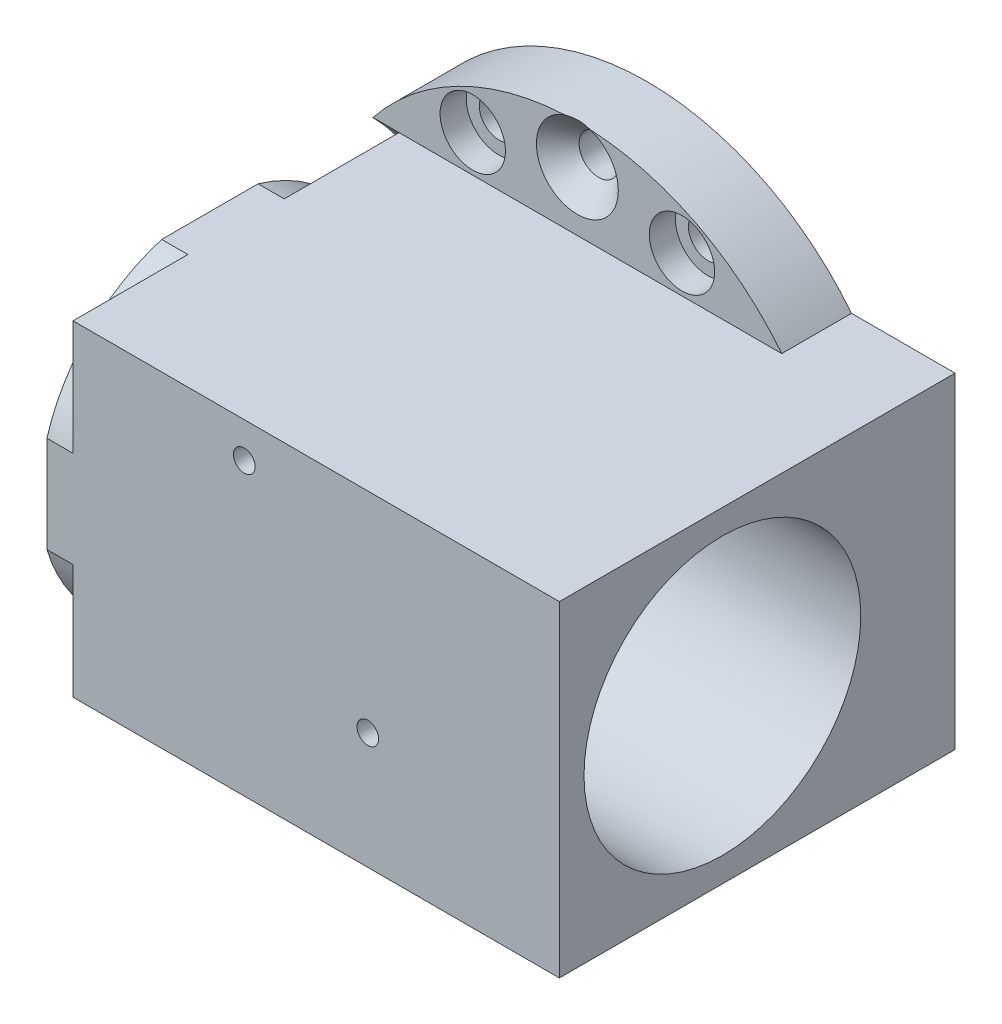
from build123d import *

# Parameters (mm, degrees)
BOSS_EXTRUDE1_DEPTH                                 = 8
CUT_EXTRUDE1_REACH                                  = 65.856
SKETCH4_W                                           = 55.8
SKETCH4_H                                           = 37.4
BOSS_EXTRUDE2_DEPTH                                 = 37.4
BOSS_EXTRUDE3_DEPTH                                 = 3
CUT_EXTRUDE2_START                                  = -3
CUT_EXTRUDE2_DEPTH                                  = 3
CUT_EXTRUDE3_START                                  = -3
CUT_EXTRUDE3_DEPTH                                  = 3
CSK_FOR_8_FLAT_HEAD_MACHINE_SCREW_100_D             = 4.5
CSK_FOR_8_FLAT_HEAD_MACHINE_SCREW_100_CSINK_D       = 9.4
CSK_FOR_8_FLAT_HEAD_MACHINE_SCREW_100_CSINK_ANGLE   = 90
F_4_CLEARANCE_HOLE1_D                               = 3.3
F_4_CLEARANCE_HOLE1_DEPTH                           = 6
CBORE_FOR_8_BINDING_HEAD_MACHINE_SCREW1_D           = 4.5
CBORE_FOR_8_BINDING_HEAD_MACHINE_SCREW1_CBORE_D     = 7.5
CBORE_FOR_8_BINDING_HEAD_MACHINE_SCREW1_CBORE_DEPTH = 3
F_2_CLEARANCE_HOLE1_D                               = 2.5
F_2_CLEARANCE_HOLE1_DEPTH                           = 6
F_2_CLEARANCE_HOLE2_REACH                           = 66.886
F_2_CLEARANCE_HOLE2_BORE_R                          = 1.25


with BuildPart() as part:
    # Sketch1 → Boss-Extrude1 (new body)
    with BuildSketch(Plane.XY.offset(8)):
        with BuildLine():
            Line((-23.45868709, 18.7), (-23.45868709, -18.7))
            ThreePointArc((-23.45868709, -18.7), (0, -30), (23.45868709, -18.7))
            Line((23.45868709, -18.7), (35.34131291, -18.7))
            Line((35.34131291, -18.7), (35.34131291, 18.7))
            Line((35.34131291, 18.7), (23.45868709, 18.7))
            ThreePointArc((23.45868709, 18.7), (0, 30), (-23.45868709, 18.7))
        make_face()
    extrude(amount=-BOSS_EXTRUDE1_DEPTH)

    # Sketch3 → Cut-Extrude1 (cut, up to next)
    with BuildSketch(Plane(origin=(-20.45868709, 0, 0), x_dir=(0, 0, -1), z_dir=(1, 0, 0)), mode=Mode.PRIVATE) as cut_extrude1_sk1:
        with BuildLine():
            Line((-8, 18.7), (-8, -18.7))
            ThreePointArc((-8, -18.7), (-0.254206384, 0), (-8, 18.7))
        make_face()
    cut_extrude1_tool1 = extrude(cut_extrude1_sk1.sketch, amount=-CUT_EXTRUDE1_REACH, mode=Mode.PRIVATE) & part.part
    add(cut_extrude1_tool1.solids().sort_by_distance((-20.458687, 0, 4.859168))[0], mode=Mode.SUBTRACT)

    # Sketch4 → Boss-Extrude2 (add)
    with BuildSketch(Plane.XY.offset(8)):
        with Locations((7.44131291, 0)):
            Rectangle(SKETCH4_W, SKETCH4_H)
    extrude(amount=BOSS_EXTRUDE2_DEPTH)

    # Sketch5 → Boss-Extrude3 (add)
    with BuildSketch(Plane.ZY.offset(20.45868709)):
        with BuildLine():
            Line((21.171890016, 18.7), (45.4, 18.7))
            Line((45.4, 18.7), (45.4, -18.7))
            Line((45.4, -18.7), (21.171890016, -18.7))
            ThreePointArc((21.171890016, -18.7), (7.2, 0), (21.171890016, 18.7))
        make_face()
    extrude(amount=BOSS_EXTRUDE3_DEPTH)

    # Sketch6 → Cut-Extrude2 (cut)
    with BuildSketch(Plane.ZY.offset(23.45868709).offset(CUT_EXTRUDE2_START)):
        with BuildLine():
            Line((45.4, -18.7), (45.4, -5.528109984))
            ThreePointArc((45.4, -5.528109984), (40.488582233, -13.788582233), (32.228109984, -18.7))
            Line((32.228109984, -18.7), (45.4, -18.7))
        make_face()
    extrude(amount=CUT_EXTRUDE2_DEPTH, mode=Mode.SUBTRACT)

    # Sketch7 → Cut-Extrude3 (cut)
    with BuildSketch(Plane.ZY.offset(23.45868709).offset(CUT_EXTRUDE3_START)):
        with BuildLine():
            Line((45.4, 18.7), (32.228109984, 18.7))
            ThreePointArc((32.228109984, 18.7), (40.488582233, 13.788582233), (45.4, 5.528109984))
            Line((45.4, 5.528109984), (45.4, 18.7))
        make_face()
    extrude(amount=CUT_EXTRUDE3_DEPTH, mode=Mode.SUBTRACT)

    # Sketch8 → Cut-Revolve1 (revolve, cut)
    with BuildSketch(Plane.XY.offset(26.7)):
        Polygon((-23.45868709, 15.875), (-23.45868709, 0), (35.34131291, 0), (35.34131291, 15.875), (9.94131291, 15.875), (9.94131291, 13.5), (1.94131291, 13.5), (1.94131291, 15.875), align=None)
    revolve(axis=Axis((-23.45868709, 0, 26.7), (1, 0, 0)), mode=Mode.SUBTRACT)

    # CSK for _8 Flat Head Machine Screw _100 (through all)
    with Locations(Plane.XY.offset(8)):
        with Locations((0, 25.5), (0, -25.5)):
            CounterSinkHole(CSK_FOR_8_FLAT_HEAD_MACHINE_SCREW_100_D / 2, CSK_FOR_8_FLAT_HEAD_MACHINE_SCREW_100_CSINK_D / 2, counter_sink_angle=CSK_FOR_8_FLAT_HEAD_MACHINE_SCREW_100_CSINK_ANGLE)

    # 4 Clearance Hole1
    with Locations(Plane(origin=(0, -18.7, 0), x_dir=(-1, 0, 0), z_dir=(0, -1, 0))):
        with Locations((12.45868709, -39.4), (-29.44131291, -39.4), (-29.44131291, -5.9)):
            Hole(F_4_CLEARANCE_HOLE1_D / 2, depth=F_4_CLEARANCE_HOLE1_DEPTH)

    # CBORE for _8 Binding Head Machine Screw1 (through all)
    with Locations(Plane.XY.offset(8)):
        with Locations((12, 22.95), (-12, 22.95), (-12, -22.95), (12, -22.95)):
            CounterBoreHole(CBORE_FOR_8_BINDING_HEAD_MACHINE_SCREW1_D / 2, CBORE_FOR_8_BINDING_HEAD_MACHINE_SCREW1_CBORE_D / 2, CBORE_FOR_8_BINDING_HEAD_MACHINE_SCREW1_CBORE_DEPTH)

    # 2 Clearance Hole1
    with Locations(Plane.XY.offset(45.4)):
        with Locations((-0.80868709, 14.63)):
            Hole(F_2_CLEARANCE_HOLE1_D / 2, depth=F_2_CLEARANCE_HOLE1_DEPTH)

    # 2 Clearance Hole2 bore → 2 Clearance Hole2 (cut, up to next)
    with BuildSketch(Plane.XY.offset(45.4), mode=Mode.PRIVATE) as f_2_clearance_hole2_sk1:
        with Locations((13.36131291, -5.33)):
            Circle(F_2_CLEARANCE_HOLE2_BORE_R)
    f_2_clearance_hole2_tool1 = extrude(f_2_clearance_hole2_sk1.sketch, amount=-F_2_CLEARANCE_HOLE2_REACH, mode=Mode.PRIVATE) & part.part
    add(f_2_clearance_hole2_tool1.solids().sort_by_distance((13.361313, -5.33, 45.4))[0], mode=Mode.SUBTRACT)


solid = part.part
